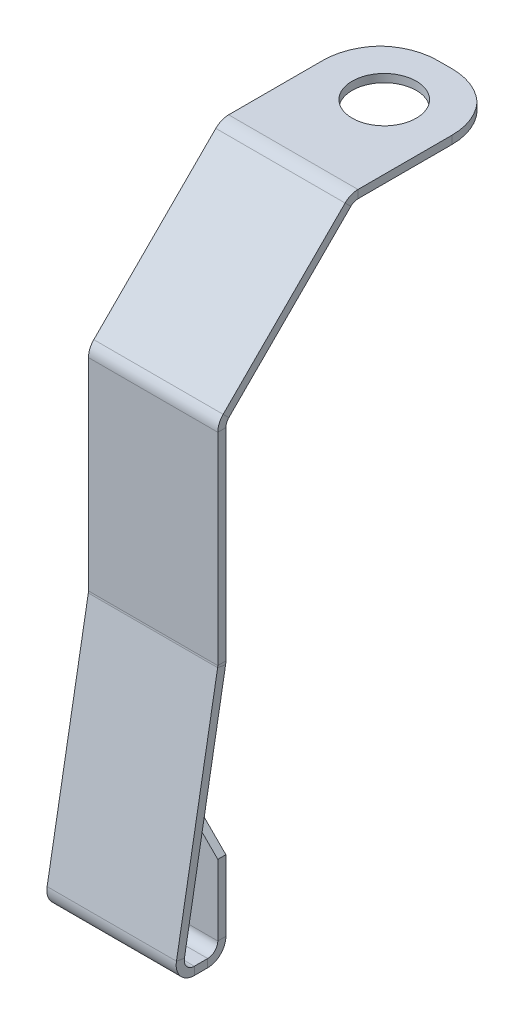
ISO-10303-21;
HEADER;
FILE_DESCRIPTION(('STEP AP214'),'2;1');
FILE_NAME('part.step','',(''),(''),'','','');
FILE_SCHEMA(('AUTOMOTIVE_DESIGN { 1 0 10303 214 1 1 1 1 }'));
ENDSEC;
DATA;
#1=APPLICATION_CONTEXT('core data for automotive mechanical design processes');
#2=APPLICATION_PROTOCOL_DEFINITION('international standard','automotive_design',2000,#1);
#3=PRODUCT_CONTEXT('',#1,'mechanical');
#4=PRODUCT('Part','Part','',(#3));
#5=PRODUCT_RELATED_PRODUCT_CATEGORY('part','',(#4));
#6=PRODUCT_DEFINITION_FORMATION('','',#4);
#7=PRODUCT_DEFINITION_CONTEXT('part definition',#1,'design');
#8=PRODUCT_DEFINITION('design','',#6,#7);
#9=PRODUCT_DEFINITION_SHAPE('','',#8);
#10=(LENGTH_UNIT() NAMED_UNIT(*) SI_UNIT(.MILLI.,.METRE.));
#11=(NAMED_UNIT(*) PLANE_ANGLE_UNIT() SI_UNIT($,.RADIAN.));
#12=(NAMED_UNIT(*) SI_UNIT($,.STERADIAN.) SOLID_ANGLE_UNIT());
#13=UNCERTAINTY_MEASURE_WITH_UNIT(LENGTH_MEASURE(1.E-05),#10,'distance_accuracy_value','');
#14=(GEOMETRIC_REPRESENTATION_CONTEXT(3) GLOBAL_UNCERTAINTY_ASSIGNED_CONTEXT((#13)) GLOBAL_UNIT_ASSIGNED_CONTEXT((#10,
#11,#12)) REPRESENTATION_CONTEXT('',''));
#15=CARTESIAN_POINT('',(0.,0.,0.));
#16=DIRECTION('',(0.,0.,1.));
#17=DIRECTION('',(1.,0.,0.));
#18=AXIS2_PLACEMENT_3D('',#15,#16,#17);
#19=CARTESIAN_POINT('',(-10.16,-94.1087382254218,-12.0896842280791));
#20=DIRECTION('',(-1.,0.,0.));
#21=DIRECTION('',(0.,0.,1.));
#22=AXIS2_PLACEMENT_3D('',#19,#20,#21);
#23=PLANE('',#22);
#24=DIRECTION('',(0.,0.,-1.));
#25=VECTOR('',#24,1.);
#26=CARTESIAN_POINT('',(-10.16,-92.8387382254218,-0.223935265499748));
#27=LINE('',#26,#25);
#28=CARTESIAN_POINT('',(-10.16,-92.8387382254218,-16.0763278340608));
#29=VERTEX_POINT('',#28);
#30=CARTESIAN_POINT('',(-10.16,-92.8387382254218,-13.9815930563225));
#31=VERTEX_POINT('',#30);
#32=EDGE_CURVE('E375',#29,#31,#27,.F.);
#33=ORIENTED_EDGE('',*,*,#32,.F.);
#34=DIRECTION('',(0.,-1.,0.));
#35=VECTOR('',#34,1.);
#36=CARTESIAN_POINT('',(-10.16,-92.8387382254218,-16.0763278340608));
#37=LINE('',#36,#35);
#38=CARTESIAN_POINT('',(-10.16,-94.1087382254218,-16.0763278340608));
#39=VERTEX_POINT('',#38);
#40=EDGE_CURVE('E357',#29,#39,#37,.T.);
#41=ORIENTED_EDGE('',*,*,#40,.T.);
#42=DIRECTION('',(0.,0.,1.));
#43=VECTOR('',#42,1.);
#44=CARTESIAN_POINT('',(-10.16,-94.1087382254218,-12.0896842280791));
#45=LINE('',#44,#43);
#46=CARTESIAN_POINT('',(-10.16,-94.1087382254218,-13.9815930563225));
#47=VERTEX_POINT('',#46);
#48=EDGE_CURVE('E369',#39,#47,#45,.T.);
#49=ORIENTED_EDGE('',*,*,#48,.T.);
#50=DIRECTION('',(0.,-1.,0.));
#51=VECTOR('',#50,1.);
#52=CARTESIAN_POINT('',(-10.16,-92.8387382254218,-13.9815930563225));
#53=LINE('',#52,#51);
#54=EDGE_CURVE('E383',#31,#47,#53,.T.);
#55=ORIENTED_EDGE('',*,*,#54,.F.);
#56=EDGE_LOOP('',(#33,#41,#49,#55));
#57=FACE_BOUND('',#56,.T.);
#58=ADVANCED_FACE('F103',(#57),#23,.T.);
#59=CARTESIAN_POINT('',(0.,-94.1087382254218,-0.223935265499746));
#60=DIRECTION('',(0.,-1.,0.));
#61=DIRECTION('',(0.,0.,-1.));
#62=AXIS2_PLACEMENT_3D('',#59,#60,#61);
#63=PLANE('',#62);
#64=ORIENTED_EDGE('',*,*,#48,.F.);
#65=DIRECTION('',(-1.,0.,0.));
#66=VECTOR('',#65,1.);
#67=CARTESIAN_POINT('',(-10.16,-94.1087382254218,-16.0763278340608));
#68=LINE('',#67,#66);
#69=CARTESIAN_POINT('',(10.1600000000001,-94.1087382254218,-16.0763278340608));
#70=VERTEX_POINT('',#69);
#71=EDGE_CURVE('E309',#39,#70,#68,.F.);
#72=ORIENTED_EDGE('',*,*,#71,.T.);
#73=DIRECTION('',(0.,0.,-1.));
#74=VECTOR('',#73,1.);
#75=CARTESIAN_POINT('',(10.1600000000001,-94.1087382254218,-22.0061571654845));
#76=LINE('',#75,#74);
#77=CARTESIAN_POINT('',(10.1600000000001,-94.1087382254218,-13.9815930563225));
#78=VERTEX_POINT('',#77);
#79=EDGE_CURVE('E372',#78,#70,#76,.T.);
#80=ORIENTED_EDGE('',*,*,#79,.F.);
#81=DIRECTION('',(-1.,0.,0.));
#82=VECTOR('',#81,1.);
#83=CARTESIAN_POINT('',(0.,-94.1087382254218,-13.9815930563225));
#84=LINE('',#83,#82);
#85=EDGE_CURVE('E380',#78,#47,#84,.T.);
#86=ORIENTED_EDGE('',*,*,#85,.T.);
#87=EDGE_LOOP('',(#64,#72,#80,#86));
#88=FACE_BOUND('',#87,.T.);
#89=ADVANCED_FACE('F668',(#88),#63,.T.);
#90=CARTESIAN_POINT('',(0.,-92.8387382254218,-0.223935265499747));
#91=DIRECTION('',(0.,-1.,0.));
#92=DIRECTION('',(0.,0.,-1.));
#93=AXIS2_PLACEMENT_3D('',#90,#91,#92);
#94=PLANE('',#93);
#95=DIRECTION('',(-1.,0.,0.));
#96=VECTOR('',#95,1.);
#97=CARTESIAN_POINT('',(-10.16,-92.8387382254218,-16.0763278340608));
#98=LINE('',#97,#96);
#99=CARTESIAN_POINT('',(10.1600000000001,-92.8387382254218,-16.0763278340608));
#100=VERTEX_POINT('',#99);
#101=EDGE_CURVE('E361',#29,#100,#98,.F.);
#102=ORIENTED_EDGE('',*,*,#101,.F.);
#103=ORIENTED_EDGE('',*,*,#32,.T.);
#104=DIRECTION('',(1.,0.,0.));
#105=VECTOR('',#104,1.);
#106=CARTESIAN_POINT('',(10.1600000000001,-92.8387382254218,-13.9815930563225));
#107=LINE('',#106,#105);
#108=CARTESIAN_POINT('',(10.1600000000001,-92.8387382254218,-13.9815930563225));
#109=VERTEX_POINT('',#108);
#110=EDGE_CURVE('E386',#109,#31,#107,.F.);
#111=ORIENTED_EDGE('',*,*,#110,.F.);
#112=DIRECTION('',(0.,0.,1.));
#113=VECTOR('',#112,1.);
#114=CARTESIAN_POINT('',(10.16,-92.8387382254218,-0.223935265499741));
#115=LINE('',#114,#113);
#116=EDGE_CURVE('E377',#109,#100,#115,.F.);
#117=ORIENTED_EDGE('',*,*,#116,.T.);
#118=EDGE_LOOP('',(#102,#103,#111,#117));
#119=FACE_BOUND('',#118,.T.);
#120=ADVANCED_FACE('F674',(#119),#94,.F.);
#121=CARTESIAN_POINT('',(0.,-31.5734459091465,-22.8924082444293));
#122=DIRECTION('',(0.,-0.173648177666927,-0.984807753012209));
#123=DIRECTION('',(0.,0.984807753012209,-0.173648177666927));
#124=AXIS2_PLACEMENT_3D('',#121,#122,#123);
#125=PLANE('',#124);
#126=DIRECTION('',(0.,0.984807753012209,-0.173648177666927));
#127=VECTOR('',#126,1.);
#128=CARTESIAN_POINT('',(10.1600000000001,-94.1087382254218,-11.8657489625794));
#129=LINE('',#128,#127);
#130=CARTESIAN_POINT('',(10.1600000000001,-90.9755717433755,-12.4182107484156));
#131=VERTEX_POINT('',#130);
#132=CARTESIAN_POINT('',(10.16,-54.2698718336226,-18.8904159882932));
#133=VERTEX_POINT('',#132);
#134=EDGE_CURVE('E427',#131,#133,#129,.T.);
#135=ORIENTED_EDGE('',*,*,#134,.F.);
#136=DIRECTION('',(-1.,0.,0.));
#137=VECTOR('',#136,1.);
#138=CARTESIAN_POINT('',(-10.16,-90.9755717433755,-12.4182107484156));
#139=LINE('',#138,#137);
#140=CARTESIAN_POINT('',(-10.16,-90.9755717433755,-12.4182107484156));
#141=VERTEX_POINT('',#140);
#142=EDGE_CURVE('E403',#141,#131,#139,.F.);
#143=ORIENTED_EDGE('',*,*,#142,.F.);
#144=DIRECTION('',(0.,-0.984807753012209,0.173648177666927));
#145=VECTOR('',#144,1.);
#146=CARTESIAN_POINT('',(-10.16,-94.1087382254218,-11.8657489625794));
#147=LINE('',#146,#145);
#148=CARTESIAN_POINT('',(-10.16,-54.2698718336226,-18.8904159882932));
#149=VERTEX_POINT('',#148);
#150=EDGE_CURVE('E414',#149,#141,#147,.T.);
#151=ORIENTED_EDGE('',*,*,#150,.F.);
#152=DIRECTION('',(1.,0.,0.));
#153=VECTOR('',#152,1.);
#154=CARTESIAN_POINT('',(0.,-54.2698718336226,-18.8904159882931));
#155=LINE('',#154,#153);
#156=EDGE_CURVE('E429',#149,#133,#155,.T.);
#157=ORIENTED_EDGE('',*,*,#156,.T.);
#158=EDGE_LOOP('',(#135,#143,#151,#157));
#159=FACE_BOUND('',#158,.T.);
#160=ADVANCED_FACE('F702',(#159),#125,.T.);
#161=CARTESIAN_POINT('',(0.,-31.3529127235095,-21.6417023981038));
#162=DIRECTION('',(0.,-0.173648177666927,-0.984807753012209));
#163=DIRECTION('',(0.,0.984807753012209,-0.173648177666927));
#164=AXIS2_PLACEMENT_3D('',#161,#162,#163);
#165=PLANE('',#164);
#166=DIRECTION('',(-1.,0.,0.));
#167=VECTOR('',#166,1.);
#168=CARTESIAN_POINT('',(-10.16,-90.7550385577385,-11.1675049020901));
#169=LINE('',#168,#167);
#170=CARTESIAN_POINT('',(-10.16,-90.7550385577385,-11.1675049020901));
#171=VERTEX_POINT('',#170);
#172=CARTESIAN_POINT('',(10.1600000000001,-90.7550385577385,-11.1675049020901));
#173=VERTEX_POINT('',#172);
#174=EDGE_CURVE('E391',#171,#173,#169,.F.);
#175=ORIENTED_EDGE('',*,*,#174,.T.);
#176=DIRECTION('',(0.,0.984807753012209,-0.173648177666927));
#177=VECTOR('',#176,1.);
#178=CARTESIAN_POINT('',(10.1600000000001,-93.8882050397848,-10.6150431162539));
#179=LINE('',#178,#177);
#180=CARTESIAN_POINT('',(10.16,-54.0493386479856,-17.6397101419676));
#181=VERTEX_POINT('',#180);
#182=EDGE_CURVE('E420',#173,#181,#179,.T.);
#183=ORIENTED_EDGE('',*,*,#182,.T.);
#184=DIRECTION('',(1.,0.,0.));
#185=VECTOR('',#184,1.);
#186=CARTESIAN_POINT('',(0.,-54.0493386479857,-17.6397101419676));
#187=LINE('',#186,#185);
#188=CARTESIAN_POINT('',(-10.16,-54.0493386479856,-17.6397101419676));
#189=VERTEX_POINT('',#188);
#190=EDGE_CURVE('E411',#189,#181,#187,.T.);
#191=ORIENTED_EDGE('',*,*,#190,.F.);
#192=DIRECTION('',(0.,-0.984807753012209,0.173648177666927));
#193=VECTOR('',#192,1.);
#194=CARTESIAN_POINT('',(-10.16,-93.8882050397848,-10.6150431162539));
#195=LINE('',#194,#193);
#196=EDGE_CURVE('E422',#189,#171,#195,.T.);
#197=ORIENTED_EDGE('',*,*,#196,.T.);
#198=EDGE_LOOP('',(#175,#183,#191,#197));
#199=FACE_BOUND('',#198,.T.);
#200=ADVANCED_FACE('F705',(#199),#165,.F.);
#201=CARTESIAN_POINT('',(-10.16,-94.1087382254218,-11.8657489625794));
#202=DIRECTION('',(-1.,0.,0.));
#203=DIRECTION('',(0.,-0.984807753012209,0.173648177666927));
#204=AXIS2_PLACEMENT_3D('',#201,#202,#203);
#205=PLANE('',#204);
#206=ORIENTED_EDGE('',*,*,#150,.T.);
#207=DIRECTION('',(0.,0.173648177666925,0.984807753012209));
#208=VECTOR('',#207,1.);
#209=CARTESIAN_POINT('',(-10.16,-90.9755717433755,-12.4182107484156));
#210=LINE('',#209,#208);
#211=EDGE_CURVE('E397',#141,#171,#210,.T.);
#212=ORIENTED_EDGE('',*,*,#211,.T.);
#213=ORIENTED_EDGE('',*,*,#196,.F.);
#214=DIRECTION('',(0.,-0.173648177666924,-0.984807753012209));
#215=VECTOR('',#214,1.);
#216=CARTESIAN_POINT('',(-10.16,-54.2698718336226,-18.890415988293));
#217=LINE('',#216,#215);
#218=EDGE_CURVE('E418',#189,#149,#217,.T.);
#219=ORIENTED_EDGE('',*,*,#218,.T.);
#220=EDGE_LOOP('',(#206,#212,#213,#219));
#221=FACE_BOUND('',#220,.T.);
#222=ADVANCED_FACE('F713',(#221),#205,.T.);
#223=CARTESIAN_POINT('',(0.,-31.1150167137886,-17.6638278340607));
#224=DIRECTION('',(0.,0.,-1.));
#225=DIRECTION('',(0.,1.,0.));
#226=AXIS2_PLACEMENT_3D('',#223,#224,#225);
#227=PLANE('',#226);
#228=DIRECTION('',(0.,-1.,0.));
#229=VECTOR('',#228,1.);
#230=CARTESIAN_POINT('',(-10.16,-94.6150167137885,-17.6638278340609));
#231=LINE('',#230,#229);
#232=CARTESIAN_POINT('',(-10.16,-22.0236721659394,-17.6638278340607));
#233=VERTEX_POINT('',#232);
#234=CARTESIAN_POINT('',(-10.16,-53.7736721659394,-17.6638278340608));
#235=VERTEX_POINT('',#234);
#236=EDGE_CURVE('E453',#233,#235,#231,.T.);
#237=ORIENTED_EDGE('',*,*,#236,.T.);
#238=DIRECTION('',(1.,0.,0.));
#239=VECTOR('',#238,1.);
#240=CARTESIAN_POINT('',(0.,-53.7736721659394,-17.6638278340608));
#241=LINE('',#240,#239);
#242=CARTESIAN_POINT('',(10.16,-53.7736721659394,-17.6638278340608));
#243=VERTEX_POINT('',#242);
#244=EDGE_CURVE('E554',#235,#243,#241,.T.);
#245=ORIENTED_EDGE('',*,*,#244,.T.);
#246=DIRECTION('',(0.,1.,0.));
#247=VECTOR('',#246,1.);
#248=CARTESIAN_POINT('',(10.1600000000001,-94.6150167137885,-17.6638278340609));
#249=LINE('',#248,#247);
#250=CARTESIAN_POINT('',(10.16,-22.0236721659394,-17.6638278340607));
#251=VERTEX_POINT('',#250);
#252=EDGE_CURVE('E449',#243,#251,#249,.T.);
#253=ORIENTED_EDGE('',*,*,#252,.T.);
#254=DIRECTION('',(1.,0.,0.));
#255=VECTOR('',#254,1.);
#256=CARTESIAN_POINT('',(0.,-22.0236721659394,-17.6638278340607));
#257=LINE('',#256,#255);
#258=EDGE_CURVE('E441',#233,#251,#257,.T.);
#259=ORIENTED_EDGE('',*,*,#258,.F.);
#260=EDGE_LOOP('',(#237,#245,#253,#259));
#261=FACE_BOUND('',#260,.T.);
#262=ADVANCED_FACE('F717',(#261),#227,.F.);
#263=CARTESIAN_POINT('',(0.,-27.6659543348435,-10.8379304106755));
#264=DIRECTION('',(0.,-0.707106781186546,-0.707106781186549));
#265=DIRECTION('',(0.,0.707106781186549,-0.707106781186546));
#266=AXIS2_PLACEMENT_3D('',#263,#264,#265);
#267=PLANE('',#266);
#268=DIRECTION('',(0.,-0.707106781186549,0.707106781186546));
#269=VECTOR('',#268,1.);
#270=CARTESIAN_POINT('',(-10.16,-72.5672349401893,34.0633501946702));
#271=LINE('',#270,#269);
#272=CARTESIAN_POINT('',(-10.16,-0.836942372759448,-37.6669423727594));
#273=VERTEX_POINT('',#272);
#274=CARTESIAN_POINT('',(-10.16,-20.0031145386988,-18.5007702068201));
#275=VERTEX_POINT('',#274);
#276=EDGE_CURVE('E545',#273,#275,#271,.T.);
#277=ORIENTED_EDGE('',*,*,#276,.T.);
#278=DIRECTION('',(1.,0.,0.));
#279=VECTOR('',#278,1.);
#280=CARTESIAN_POINT('',(0.,-20.0031145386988,-18.5007702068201));
#281=LINE('',#280,#279);
#282=CARTESIAN_POINT('',(10.16,-20.0031145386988,-18.5007702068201));
#283=VERTEX_POINT('',#282);
#284=EDGE_CURVE('E534',#275,#283,#281,.T.);
#285=ORIENTED_EDGE('',*,*,#284,.T.);
#286=DIRECTION('',(0.,0.707106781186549,-0.707106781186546));
#287=VECTOR('',#286,1.);
#288=CARTESIAN_POINT('',(10.16,-72.5672349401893,34.0633501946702));
#289=LINE('',#288,#287);
#290=CARTESIAN_POINT('',(10.16,-0.836942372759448,-37.6669423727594));
#291=VERTEX_POINT('',#290);
#292=EDGE_CURVE('E487',#283,#291,#289,.T.);
#293=ORIENTED_EDGE('',*,*,#292,.T.);
#294=DIRECTION('',(1.,0.,0.));
#295=VECTOR('',#294,1.);
#296=CARTESIAN_POINT('',(0.,-0.836942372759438,-37.6669423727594));
#297=LINE('',#296,#295);
#298=EDGE_CURVE('E523',#273,#291,#297,.T.);
#299=ORIENTED_EDGE('',*,*,#298,.F.);
#300=EDGE_LOOP('',(#277,#285,#293,#299));
#301=FACE_BOUND('',#300,.T.);
#302=ADVANCED_FACE('F1085',(#301),#267,.F.);
#303=CARTESIAN_POINT('',(10.16,-73.4652605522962,33.1653245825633));
#304=DIRECTION('',(1.,0.,0.));
#305=DIRECTION('',(0.,0.707106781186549,-0.707106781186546));
#306=AXIS2_PLACEMENT_3D('',#303,#304,#305);
#307=PLANE('',#306);
#308=DIRECTION('',(0.,0.707106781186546,0.707106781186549));
#309=VECTOR('',#308,1.);
#310=CARTESIAN_POINT('',(10.16,-20.9011401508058,-19.398795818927));
#311=LINE('',#310,#309);
#312=CARTESIAN_POINT('',(10.16,-20.9011401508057,-19.398795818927));
#313=VERTEX_POINT('',#312);
#314=EDGE_CURVE('E531',#313,#283,#311,.T.);
#315=ORIENTED_EDGE('',*,*,#314,.F.);
#316=DIRECTION('',(0.,0.707106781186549,-0.707106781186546));
#317=VECTOR('',#316,1.);
#318=CARTESIAN_POINT('',(10.16,-73.4652605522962,33.1653245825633));
#319=LINE('',#318,#317);
#320=CARTESIAN_POINT('',(10.16,-1.73496798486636,-38.5649679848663));
#321=VERTEX_POINT('',#320);
#322=EDGE_CURVE('E542',#313,#321,#319,.T.);
#323=ORIENTED_EDGE('',*,*,#322,.T.);
#324=DIRECTION('',(0.,0.707106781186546,0.707106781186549));
#325=VECTOR('',#324,1.);
#326=CARTESIAN_POINT('',(10.16,-1.73496798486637,-38.5649679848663));
#327=LINE('',#326,#325);
#328=EDGE_CURVE('E525',#321,#291,#327,.T.);
#329=ORIENTED_EDGE('',*,*,#328,.T.);
#330=ORIENTED_EDGE('',*,*,#292,.F.);
#331=EDGE_LOOP('',(#315,#323,#329,#330));
#332=FACE_BOUND('',#331,.T.);
#333=ADVANCED_FACE('F631',(#332),#307,.T.);
#334=CARTESIAN_POINT('',(-10.16,-73.4652605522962,33.1653245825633));
#335=DIRECTION('',(-1.,0.,0.));
#336=DIRECTION('',(0.,-0.707106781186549,0.707106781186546));
#337=AXIS2_PLACEMENT_3D('',#334,#335,#336);
#338=PLANE('',#337);
#339=DIRECTION('',(0.,-0.707106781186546,-0.707106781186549));
#340=VECTOR('',#339,1.);
#341=CARTESIAN_POINT('',(-10.16,-20.9011401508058,-19.398795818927));
#342=LINE('',#341,#340);
#343=CARTESIAN_POINT('',(-10.16,-20.9011401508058,-19.398795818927));
#344=VERTEX_POINT('',#343);
#345=EDGE_CURVE('E537',#275,#344,#342,.T.);
#346=ORIENTED_EDGE('',*,*,#345,.F.);
#347=ORIENTED_EDGE('',*,*,#276,.F.);
#348=DIRECTION('',(0.,-0.707106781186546,-0.707106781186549));
#349=VECTOR('',#348,1.);
#350=CARTESIAN_POINT('',(-10.16,-1.73496798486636,-38.5649679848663));
#351=LINE('',#350,#349);
#352=CARTESIAN_POINT('',(-10.16,-1.73496798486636,-38.5649679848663));
#353=VERTEX_POINT('',#352);
#354=EDGE_CURVE('E519',#273,#353,#351,.T.);
#355=ORIENTED_EDGE('',*,*,#354,.T.);
#356=DIRECTION('',(0.,-0.707106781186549,0.707106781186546));
#357=VECTOR('',#356,1.);
#358=CARTESIAN_POINT('',(-10.16,-73.4652605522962,33.1653245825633));
#359=LINE('',#358,#357);
#360=EDGE_CURVE('E520',#353,#344,#359,.T.);
#361=ORIENTED_EDGE('',*,*,#360,.T.);
#362=EDGE_LOOP('',(#346,#347,#355,#361));
#363=FACE_BOUND('',#362,.T.);
#364=ADVANCED_FACE('F1138',(#363),#338,.T.);
#365=CARTESIAN_POINT('',(0.,-28.5639799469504,-11.7359560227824));
#366=DIRECTION('',(0.,-0.707106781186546,-0.707106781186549));
#367=DIRECTION('',(0.,0.707106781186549,-0.707106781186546));
#368=AXIS2_PLACEMENT_3D('',#365,#366,#367);
#369=PLANE('',#368);
#370=DIRECTION('',(1.,0.,0.));
#371=VECTOR('',#370,1.);
#372=CARTESIAN_POINT('',(0.,-20.9011401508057,-19.398795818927));
#373=LINE('',#372,#371);
#374=EDGE_CURVE('E528',#344,#313,#373,.T.);
#375=ORIENTED_EDGE('',*,*,#374,.F.);
#376=ORIENTED_EDGE('',*,*,#360,.F.);
#377=DIRECTION('',(1.,0.,0.));
#378=VECTOR('',#377,1.);
#379=CARTESIAN_POINT('',(0.,-1.73496798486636,-38.5649679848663));
#380=LINE('',#379,#378);
#381=EDGE_CURVE('E516',#353,#321,#380,.T.);
#382=ORIENTED_EDGE('',*,*,#381,.T.);
#383=ORIENTED_EDGE('',*,*,#322,.F.);
#384=EDGE_LOOP('',(#375,#376,#382,#383));
#385=FACE_BOUND('',#384,.T.);
#386=ADVANCED_FACE('F635',(#385),#369,.T.);
#387=CARTESIAN_POINT('',(0.,0.,-53.975));
#388=DIRECTION('',(0.,1.,0.));
#389=DIRECTION('',(0.,0.,1.));
#390=AXIS2_PLACEMENT_3D('',#387,#388,#389);
#391=CYLINDRICAL_SURFACE('',#390,5.04189999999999);
#392=CARTESIAN_POINT('',(0.,0.,-53.975));
#393=DIRECTION('',(0.,1.,0.));
#394=DIRECTION('',(0.,0.,1.));
#395=AXIS2_PLACEMENT_3D('',#392,#393,#394);
#396=CIRCLE('',#395,5.04189999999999);
#397=CARTESIAN_POINT('',(0.,0.,-48.9331));
#398=VERTEX_POINT('',#397);
#399=EDGE_CURVE('E505',#398,#398,#396,.T.);
#400=ORIENTED_EDGE('',*,*,#399,.T.);
#401=EDGE_LOOP('',(#400));
#402=FACE_BOUND('',#401,.T.);
#403=CARTESIAN_POINT('',(0.,-1.27,-53.975));
#404=DIRECTION('',(0.,-1.,0.));
#405=DIRECTION('',(0.,0.,-1.));
#406=AXIS2_PLACEMENT_3D('',#403,#404,#405);
#407=CIRCLE('',#406,5.04189999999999);
#408=CARTESIAN_POINT('',(0.,-1.27,-59.0169));
#409=VERTEX_POINT('',#408);
#410=EDGE_CURVE('E502',#409,#409,#407,.T.);
#411=ORIENTED_EDGE('',*,*,#410,.T.);
#412=EDGE_LOOP('',(#411));
#413=FACE_BOUND('',#412,.T.);
#414=ADVANCED_FACE('F658',(#402,#413),#391,.F.);
#415=CARTESIAN_POINT('',(-10.16,-1.27,-63.5));
#416=DIRECTION('',(0.,0.,-1.));
#417=DIRECTION('',(-1.,0.,0.));
#418=AXIS2_PLACEMENT_3D('',#415,#416,#417);
#419=PLANE('',#418);
#420=DIRECTION('',(-1.,0.,0.));
#421=VECTOR('',#420,1.);
#422=CARTESIAN_POINT('',(-10.16,-1.27,-63.5));
#423=LINE('',#422,#421);
#424=CARTESIAN_POINT('',(1.13461581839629,-1.27,-63.5));
#425=VERTEX_POINT('',#424);
#426=CARTESIAN_POINT('',(-1.13461581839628,-1.27,-63.5));
#427=VERTEX_POINT('',#426);
#428=EDGE_CURVE('E499',#425,#427,#423,.T.);
#429=ORIENTED_EDGE('',*,*,#428,.T.);
#430=DIRECTION('',(0.,-1.,0.));
#431=VECTOR('',#430,1.);
#432=CARTESIAN_POINT('',(-1.13461581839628,-1.27,-63.5));
#433=LINE('',#432,#431);
#434=CARTESIAN_POINT('',(-1.13461581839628,0.,-63.5));
#435=VERTEX_POINT('',#434);
#436=EDGE_CURVE('E112',#427,#435,#433,.F.);
#437=ORIENTED_EDGE('',*,*,#436,.T.);
#438=DIRECTION('',(-1.,0.,0.));
#439=VECTOR('',#438,1.);
#440=CARTESIAN_POINT('',(-10.16,0.,-63.5));
#441=LINE('',#440,#439);
#442=CARTESIAN_POINT('',(1.13461581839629,0.,-63.5));
#443=VERTEX_POINT('',#442);
#444=EDGE_CURVE('E488',#443,#435,#441,.T.);
#445=ORIENTED_EDGE('',*,*,#444,.F.);
#446=DIRECTION('',(0.,1.,0.));
#447=VECTOR('',#446,1.);
#448=CARTESIAN_POINT('',(1.13461581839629,-1.27,-63.5));
#449=LINE('',#448,#447);
#450=EDGE_CURVE('E598',#443,#425,#449,.F.);
#451=ORIENTED_EDGE('',*,*,#450,.T.);
#452=EDGE_LOOP('',(#429,#437,#445,#451));
#453=FACE_BOUND('',#452,.T.);
#454=ADVANCED_FACE('F656',(#453),#419,.T.);
#455=CARTESIAN_POINT('',(0.,-1.27,0.));
#456=DIRECTION('',(0.,-1.,0.));
#457=DIRECTION('',(0.,0.,-1.));
#458=AXIS2_PLACEMENT_3D('',#455,#456,#457);
#459=PLANE('',#458);
#460=DIRECTION('',(0.,0.,1.));
#461=VECTOR('',#460,1.);
#462=CARTESIAN_POINT('',(-10.16,-1.27,63.5));
#463=LINE('',#462,#461);
#464=CARTESIAN_POINT('',(-10.16,-1.27,-54.4746158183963));
#465=VERTEX_POINT('',#464);
#466=CARTESIAN_POINT('',(-10.16,-1.27,-39.6875));
#467=VERTEX_POINT('',#466);
#468=EDGE_CURVE('E497',#465,#467,#463,.T.);
#469=ORIENTED_EDGE('',*,*,#468,.F.);
#470=CARTESIAN_POINT('',(-0.635000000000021,-1.27,-54.4746158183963));
#471=DIRECTION('',(0.,-1.,0.));
#472=DIRECTION('',(0.,0.,-1.));
#473=AXIS2_PLACEMENT_3D('',#470,#471,#472);
#474=CIRCLE('',#473,9.525);
#475=CARTESIAN_POINT('',(-7.61536572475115,-1.27,-60.9553657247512));
#476=VERTEX_POINT('',#475);
#477=EDGE_CURVE('E590',#465,#476,#474,.T.);
#478=ORIENTED_EDGE('',*,*,#477,.T.);
#479=CARTESIAN_POINT('',(-1.13461581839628,-1.27,-53.975));
#480=DIRECTION('',(0.,-1.,0.));
#481=DIRECTION('',(0.,0.,-1.));
#482=AXIS2_PLACEMENT_3D('',#479,#480,#481);
#483=CIRCLE('',#482,9.525);
#484=EDGE_CURVE('E588',#476,#427,#483,.T.);
#485=ORIENTED_EDGE('',*,*,#484,.T.);
#486=ORIENTED_EDGE('',*,*,#428,.F.);
#487=CARTESIAN_POINT('',(1.13461581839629,-1.27,-53.975));
#488=DIRECTION('',(0.,-1.,0.));
#489=DIRECTION('',(0.,0.,-1.));
#490=AXIS2_PLACEMENT_3D('',#487,#488,#489);
#491=CIRCLE('',#490,9.525);
#492=CARTESIAN_POINT('',(7.61536572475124,-1.27,-60.9553657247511));
#493=VERTEX_POINT('',#492);
#494=EDGE_CURVE('E586',#425,#493,#491,.T.);
#495=ORIENTED_EDGE('',*,*,#494,.T.);
#496=CARTESIAN_POINT('',(0.635000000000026,-1.27,-54.4746158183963));
#497=DIRECTION('',(0.,-1.,0.));
#498=DIRECTION('',(0.,0.,-1.));
#499=AXIS2_PLACEMENT_3D('',#496,#497,#498);
#500=CIRCLE('',#499,9.525);
#501=CARTESIAN_POINT('',(10.16,-1.27,-54.4746158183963));
#502=VERTEX_POINT('',#501);
#503=EDGE_CURVE('E584',#493,#502,#500,.T.);
#504=ORIENTED_EDGE('',*,*,#503,.T.);
#505=DIRECTION('',(0.,0.,-1.));
#506=VECTOR('',#505,1.);
#507=CARTESIAN_POINT('',(10.16,-1.27,63.5));
#508=LINE('',#507,#506);
#509=CARTESIAN_POINT('',(10.16,-1.27,-39.6875));
#510=VERTEX_POINT('',#509);
#511=EDGE_CURVE('E484',#510,#502,#508,.T.);
#512=ORIENTED_EDGE('',*,*,#511,.F.);
#513=DIRECTION('',(1.,0.,0.));
#514=VECTOR('',#513,1.);
#515=CARTESIAN_POINT('',(0.,-1.27,-39.6875));
#516=LINE('',#515,#514);
#517=EDGE_CURVE('E479',#467,#510,#516,.T.);
#518=ORIENTED_EDGE('',*,*,#517,.F.);
#519=EDGE_LOOP('',(#469,#478,#485,#486,#495,#504,#512,#518));
#520=FACE_BOUND('',#519,.T.);
#521=ORIENTED_EDGE('',*,*,#410,.F.);
#522=EDGE_LOOP('',(#521));
#523=FACE_BOUND('',#522,.T.);
#524=ADVANCED_FACE('F614',(#520,#523),#459,.T.);
#525=CARTESIAN_POINT('',(-10.16,-1.27,63.5));
#526=DIRECTION('',(-1.,0.,0.));
#527=DIRECTION('',(0.,0.,1.));
#528=AXIS2_PLACEMENT_3D('',#525,#526,#527);
#529=PLANE('',#528);
#530=DIRECTION('',(0.,0.,1.));
#531=VECTOR('',#530,1.);
#532=CARTESIAN_POINT('',(-10.16,0.,63.5));
#533=LINE('',#532,#531);
#534=CARTESIAN_POINT('',(-10.16,0.,-54.4746158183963));
#535=VERTEX_POINT('',#534);
#536=CARTESIAN_POINT('',(-10.16,0.,-39.6875));
#537=VERTEX_POINT('',#536);
#538=EDGE_CURVE('E495',#535,#537,#533,.T.);
#539=ORIENTED_EDGE('',*,*,#538,.F.);
#540=DIRECTION('',(0.,1.,0.));
#541=VECTOR('',#540,1.);
#542=CARTESIAN_POINT('',(-10.16,-1.27,-54.4746158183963));
#543=LINE('',#542,#541);
#544=EDGE_CURVE('E581',#535,#465,#543,.F.);
#545=ORIENTED_EDGE('',*,*,#544,.T.);
#546=ORIENTED_EDGE('',*,*,#468,.T.);
#547=DIRECTION('',(0.,-1.,0.));
#548=VECTOR('',#547,1.);
#549=CARTESIAN_POINT('',(-10.16,-1.27000000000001,-39.6875));
#550=LINE('',#549,#548);
#551=EDGE_CURVE('E508',#537,#467,#550,.T.);
#552=ORIENTED_EDGE('',*,*,#551,.F.);
#553=EDGE_LOOP('',(#539,#545,#546,#552));
#554=FACE_BOUND('',#553,.T.);
#555=ADVANCED_FACE('F643',(#554),#529,.T.);
#556=CARTESIAN_POINT('',(0.,0.,0.));
#557=DIRECTION('',(0.,-1.,0.));
#558=DIRECTION('',(0.,0.,-1.));
#559=AXIS2_PLACEMENT_3D('',#556,#557,#558);
#560=PLANE('',#559);
#561=ORIENTED_EDGE('',*,*,#399,.F.);
#562=EDGE_LOOP('',(#561));
#563=FACE_BOUND('',#562,.T.);
#564=CARTESIAN_POINT('',(-1.13461581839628,0.,-53.975));
#565=DIRECTION('',(0.,-1.,0.));
#566=DIRECTION('',(0.,0.,-1.));
#567=AXIS2_PLACEMENT_3D('',#564,#565,#566);
#568=CIRCLE('',#567,9.525);
#569=CARTESIAN_POINT('',(-7.61536572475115,0.,-60.9553657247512));
#570=VERTEX_POINT('',#569);
#571=EDGE_CURVE('E120',#435,#570,#568,.F.);
#572=ORIENTED_EDGE('',*,*,#571,.T.);
#573=CARTESIAN_POINT('',(-0.635000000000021,0.,-54.4746158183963));
#574=DIRECTION('',(0.,-1.,0.));
#575=DIRECTION('',(0.,0.,-1.));
#576=AXIS2_PLACEMENT_3D('',#573,#574,#575);
#577=CIRCLE('',#576,9.525);
#578=EDGE_CURVE('E596',#570,#535,#577,.F.);
#579=ORIENTED_EDGE('',*,*,#578,.T.);
#580=ORIENTED_EDGE('',*,*,#538,.T.);
#581=DIRECTION('',(1.,0.,0.));
#582=VECTOR('',#581,1.);
#583=CARTESIAN_POINT('',(0.,0.,-39.6875));
#584=LINE('',#583,#582);
#585=CARTESIAN_POINT('',(10.16,0.,-39.6875));
#586=VERTEX_POINT('',#585);
#587=EDGE_CURVE('E492',#537,#586,#584,.T.);
#588=ORIENTED_EDGE('',*,*,#587,.T.);
#589=DIRECTION('',(0.,0.,-1.));
#590=VECTOR('',#589,1.);
#591=CARTESIAN_POINT('',(10.16,0.,63.5));
#592=LINE('',#591,#590);
#593=CARTESIAN_POINT('',(10.16,0.,-54.4746158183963));
#594=VERTEX_POINT('',#593);
#595=EDGE_CURVE('E490',#586,#594,#592,.T.);
#596=ORIENTED_EDGE('',*,*,#595,.T.);
#597=CARTESIAN_POINT('',(0.635000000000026,0.,-54.4746158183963));
#598=DIRECTION('',(0.,-1.,0.));
#599=DIRECTION('',(0.,0.,-1.));
#600=AXIS2_PLACEMENT_3D('',#597,#598,#599);
#601=CIRCLE('',#600,9.525);
#602=CARTESIAN_POINT('',(7.61536572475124,0.,-60.9553657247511));
#603=VERTEX_POINT('',#602);
#604=EDGE_CURVE('E127',#594,#603,#601,.F.);
#605=ORIENTED_EDGE('',*,*,#604,.T.);
#606=CARTESIAN_POINT('',(1.13461581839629,0.,-53.975));
#607=DIRECTION('',(0.,-1.,0.));
#608=DIRECTION('',(0.,0.,-1.));
#609=AXIS2_PLACEMENT_3D('',#606,#607,#608);
#610=CIRCLE('',#609,9.525);
#611=EDGE_CURVE('E593',#603,#443,#610,.F.);
#612=ORIENTED_EDGE('',*,*,#611,.T.);
#613=ORIENTED_EDGE('',*,*,#444,.T.);
#614=EDGE_LOOP('',(#572,#579,#580,#588,#596,#605,#612,#613));
#615=FACE_BOUND('',#614,.T.);
#616=ADVANCED_FACE('F648',(#563,#615),#560,.F.);
#617=CARTESIAN_POINT('',(10.16,-1.27,63.5));
#618=DIRECTION('',(1.,0.,0.));
#619=DIRECTION('',(0.,0.,-1.));
#620=AXIS2_PLACEMENT_3D('',#617,#618,#619);
#621=PLANE('',#620);
#622=ORIENTED_EDGE('',*,*,#511,.T.);
#623=DIRECTION('',(0.,-1.,0.));
#624=VECTOR('',#623,1.);
#625=CARTESIAN_POINT('',(10.16,-1.27,-54.4746158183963));
#626=LINE('',#625,#624);
#627=EDGE_CURVE('E15',#502,#594,#626,.F.);
#628=ORIENTED_EDGE('',*,*,#627,.T.);
#629=ORIENTED_EDGE('',*,*,#595,.F.);
#630=DIRECTION('',(0.,1.,0.));
#631=VECTOR('',#630,1.);
#632=CARTESIAN_POINT('',(10.16,-1.27000000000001,-39.6875));
#633=LINE('',#632,#631);
#634=EDGE_CURVE('E511',#510,#586,#633,.T.);
#635=ORIENTED_EDGE('',*,*,#634,.F.);
#636=EDGE_LOOP('',(#622,#628,#629,#635));
#637=FACE_BOUND('',#636,.T.);
#638=ADVANCED_FACE('F620',(#637),#621,.T.);
#639=CARTESIAN_POINT('',(-10.16,-2.8575,-39.6875));
#640=DIRECTION('',(1.,0.,0.));
#641=DIRECTION('',(0.,0.,-1.));
#642=AXIS2_PLACEMENT_3D('',#639,#640,#641);
#643=PLANE('',#642);
#644=ORIENTED_EDGE('',*,*,#354,.F.);
#645=CARTESIAN_POINT('',(-10.16,-2.8575,-39.6875));
#646=DIRECTION('',(-1.,0.,0.));
#647=DIRECTION('',(0.,0.,1.));
#648=AXIS2_PLACEMENT_3D('',#645,#646,#647);
#649=CIRCLE('',#648,2.8575);
#650=EDGE_CURVE('E467',#273,#537,#649,.T.);
#651=ORIENTED_EDGE('',*,*,#650,.T.);
#652=ORIENTED_EDGE('',*,*,#551,.T.);
#653=CARTESIAN_POINT('',(-10.16,-2.8575,-39.6875));
#654=DIRECTION('',(-1.,0.,0.));
#655=DIRECTION('',(0.,0.,-1.));
#656=AXIS2_PLACEMENT_3D('',#653,#654,#655);
#657=CIRCLE('',#656,1.5875);
#658=EDGE_CURVE('E473',#353,#467,#657,.T.);
#659=ORIENTED_EDGE('',*,*,#658,.F.);
#660=EDGE_LOOP('',(#644,#651,#652,#659));
#661=FACE_BOUND('',#660,.T.);
#662=ADVANCED_FACE('F637',(#661),#643,.F.);
#663=CARTESIAN_POINT('',(10.16,-2.8575,-39.6875));
#664=DIRECTION('',(-1.,0.,0.));
#665=DIRECTION('',(0.,0.,1.));
#666=AXIS2_PLACEMENT_3D('',#663,#664,#665);
#667=PLANE('',#666);
#668=CARTESIAN_POINT('',(10.16,-2.8575,-39.6875));
#669=DIRECTION('',(-1.,0.,0.));
#670=DIRECTION('',(0.,0.,1.));
#671=AXIS2_PLACEMENT_3D('',#668,#669,#670);
#672=CIRCLE('',#671,2.8575);
#673=EDGE_CURVE('E477',#586,#291,#672,.F.);
#674=ORIENTED_EDGE('',*,*,#673,.T.);
#675=ORIENTED_EDGE('',*,*,#328,.F.);
#676=CARTESIAN_POINT('',(10.16,-2.8575,-39.6875));
#677=DIRECTION('',(1.,0.,0.));
#678=DIRECTION('',(0.,0.,1.));
#679=AXIS2_PLACEMENT_3D('',#676,#677,#678);
#680=CIRCLE('',#679,1.5875);
#681=EDGE_CURVE('E476',#510,#321,#680,.T.);
#682=ORIENTED_EDGE('',*,*,#681,.F.);
#683=ORIENTED_EDGE('',*,*,#634,.T.);
#684=EDGE_LOOP('',(#674,#675,#682,#683));
#685=FACE_BOUND('',#684,.T.);
#686=ADVANCED_FACE('F628',(#685),#667,.F.);
#687=CARTESIAN_POINT('',(20.4343396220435,-2.8575,-39.6875));
#688=DIRECTION('',(-1.,0.,0.));
#689=DIRECTION('',(0.,0.,1.));
#690=AXIS2_PLACEMENT_3D('',#687,#688,#689);
#691=CYLINDRICAL_SURFACE('',#690,1.5875);
#692=ORIENTED_EDGE('',*,*,#517,.T.);
#693=ORIENTED_EDGE('',*,*,#681,.T.);
#694=ORIENTED_EDGE('',*,*,#381,.F.);
#695=ORIENTED_EDGE('',*,*,#658,.T.);
#696=EDGE_LOOP('',(#692,#693,#694,#695));
#697=FACE_BOUND('',#696,.T.);
#698=ADVANCED_FACE('F625',(#697),#691,.F.);
#699=CARTESIAN_POINT('',(20.4343396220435,-2.8575,-39.6875));
#700=DIRECTION('',(-1.,0.,0.));
#701=DIRECTION('',(0.,0.,1.));
#702=AXIS2_PLACEMENT_3D('',#699,#700,#701);
#703=CYLINDRICAL_SURFACE('',#702,2.8575);
#704=ORIENTED_EDGE('',*,*,#587,.F.);
#705=ORIENTED_EDGE('',*,*,#650,.F.);
#706=ORIENTED_EDGE('',*,*,#298,.T.);
#707=ORIENTED_EDGE('',*,*,#673,.F.);
#708=EDGE_LOOP('',(#704,#705,#706,#707));
#709=FACE_BOUND('',#708,.T.);
#710=ADVANCED_FACE('F646',(#709),#703,.T.);
#711=CARTESIAN_POINT('',(-10.16,-22.0236721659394,-20.5213278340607));
#712=DIRECTION('',(1.,0.,0.));
#713=DIRECTION('',(0.,0.,-1.));
#714=AXIS2_PLACEMENT_3D('',#711,#712,#713);
#715=PLANE('',#714);
#716=DIRECTION('',(0.,0.,-1.));
#717=VECTOR('',#716,1.);
#718=CARTESIAN_POINT('',(-10.16,-22.0236721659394,-18.9338278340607));
#719=LINE('',#718,#717);
#720=CARTESIAN_POINT('',(-10.16,-22.0236721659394,-18.9338278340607));
#721=VERTEX_POINT('',#720);
#722=EDGE_CURVE('E446',#233,#721,#719,.T.);
#723=ORIENTED_EDGE('',*,*,#722,.F.);
#724=CARTESIAN_POINT('',(-10.16,-22.0236721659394,-20.5213278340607));
#725=DIRECTION('',(-1.,0.,0.));
#726=DIRECTION('',(0.,0.,1.));
#727=AXIS2_PLACEMENT_3D('',#724,#725,#726);
#728=CIRCLE('',#727,2.8575);
#729=EDGE_CURVE('E468',#233,#275,#728,.T.);
#730=ORIENTED_EDGE('',*,*,#729,.T.);
#731=ORIENTED_EDGE('',*,*,#345,.T.);
#732=CARTESIAN_POINT('',(-10.16,-22.0236721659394,-20.5213278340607));
#733=DIRECTION('',(-1.,0.,0.));
#734=DIRECTION('',(0.,0.,-1.));
#735=AXIS2_PLACEMENT_3D('',#732,#733,#734);
#736=CIRCLE('',#735,1.5875);
#737=EDGE_CURVE('E460',#721,#344,#736,.T.);
#738=ORIENTED_EDGE('',*,*,#737,.F.);
#739=EDGE_LOOP('',(#723,#730,#731,#738));
#740=FACE_BOUND('',#739,.T.);
#741=ADVANCED_FACE('F745',(#740),#715,.F.);
#742=CARTESIAN_POINT('',(10.16,-22.0236721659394,-20.5213278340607));
#743=DIRECTION('',(-1.,0.,0.));
#744=DIRECTION('',(0.,0.,1.));
#745=AXIS2_PLACEMENT_3D('',#742,#743,#744);
#746=PLANE('',#745);
#747=CARTESIAN_POINT('',(10.16,-22.0236721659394,-20.5213278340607));
#748=DIRECTION('',(-1.,0.,0.));
#749=DIRECTION('',(0.,0.,1.));
#750=AXIS2_PLACEMENT_3D('',#747,#748,#749);
#751=CIRCLE('',#750,2.8575);
#752=EDGE_CURVE('E464',#283,#251,#751,.F.);
#753=ORIENTED_EDGE('',*,*,#752,.T.);
#754=DIRECTION('',(0.,0.,1.));
#755=VECTOR('',#754,1.);
#756=CARTESIAN_POINT('',(10.16,-22.0236721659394,-18.9338278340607));
#757=LINE('',#756,#755);
#758=CARTESIAN_POINT('',(10.16,-22.0236721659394,-18.9338278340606));
#759=VERTEX_POINT('',#758);
#760=EDGE_CURVE('E450',#759,#251,#757,.T.);
#761=ORIENTED_EDGE('',*,*,#760,.F.);
#762=CARTESIAN_POINT('',(10.16,-22.0236721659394,-20.5213278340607));
#763=DIRECTION('',(1.,0.,0.));
#764=DIRECTION('',(0.,0.,1.));
#765=AXIS2_PLACEMENT_3D('',#762,#763,#764);
#766=CIRCLE('',#765,1.5875);
#767=EDGE_CURVE('E463',#313,#759,#766,.T.);
#768=ORIENTED_EDGE('',*,*,#767,.F.);
#769=ORIENTED_EDGE('',*,*,#314,.T.);
#770=EDGE_LOOP('',(#753,#761,#768,#769));
#771=FACE_BOUND('',#770,.T.);
#772=ADVANCED_FACE('F739',(#771),#746,.F.);
#773=CARTESIAN_POINT('',(20.5425394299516,-22.0236721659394,-20.5213278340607));
#774=DIRECTION('',(-1.,0.,0.));
#775=DIRECTION('',(0.,0.,1.));
#776=AXIS2_PLACEMENT_3D('',#773,#774,#775);
#777=CYLINDRICAL_SURFACE('',#776,1.5875);
#778=ORIENTED_EDGE('',*,*,#374,.T.);
#779=ORIENTED_EDGE('',*,*,#767,.T.);
#780=DIRECTION('',(1.,0.,0.));
#781=VECTOR('',#780,1.);
#782=CARTESIAN_POINT('',(0.,-22.0236721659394,-18.9338278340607));
#783=LINE('',#782,#781);
#784=EDGE_CURVE('E455',#721,#759,#783,.T.);
#785=ORIENTED_EDGE('',*,*,#784,.F.);
#786=ORIENTED_EDGE('',*,*,#737,.T.);
#787=EDGE_LOOP('',(#778,#779,#785,#786));
#788=FACE_BOUND('',#787,.T.);
#789=ADVANCED_FACE('F735',(#788),#777,.F.);
#790=CARTESIAN_POINT('',(20.5425394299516,-22.0236721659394,-20.5213278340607));
#791=DIRECTION('',(-1.,0.,0.));
#792=DIRECTION('',(0.,0.,1.));
#793=AXIS2_PLACEMENT_3D('',#790,#791,#792);
#794=CYLINDRICAL_SURFACE('',#793,2.8575);
#795=ORIENTED_EDGE('',*,*,#284,.F.);
#796=ORIENTED_EDGE('',*,*,#729,.F.);
#797=ORIENTED_EDGE('',*,*,#258,.T.);
#798=ORIENTED_EDGE('',*,*,#752,.F.);
#799=EDGE_LOOP('',(#795,#796,#797,#798));
#800=FACE_BOUND('',#799,.T.);
#801=ADVANCED_FACE('F738',(#800),#794,.T.);
#802=CARTESIAN_POINT('',(0.,-31.1150167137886,-18.9338278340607));
#803=DIRECTION('',(0.,0.,-1.));
#804=DIRECTION('',(0.,1.,0.));
#805=AXIS2_PLACEMENT_3D('',#802,#803,#804);
#806=PLANE('',#805);
#807=DIRECTION('',(1.,0.,0.));
#808=VECTOR('',#807,1.);
#809=CARTESIAN_POINT('',(0.,-53.7736721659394,-18.9338278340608));
#810=LINE('',#809,#808);
#811=CARTESIAN_POINT('',(-10.16,-53.7736721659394,-18.9338278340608));
#812=VERTEX_POINT('',#811);
#813=CARTESIAN_POINT('',(10.16,-53.7736721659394,-18.9338278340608));
#814=VERTEX_POINT('',#813);
#815=EDGE_CURVE('E540',#812,#814,#810,.T.);
#816=ORIENTED_EDGE('',*,*,#815,.F.);
#817=DIRECTION('',(0.,-1.,0.));
#818=VECTOR('',#817,1.);
#819=CARTESIAN_POINT('',(-10.16,-94.6150167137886,-18.9338278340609));
#820=LINE('',#819,#818);
#821=EDGE_CURVE('E448',#721,#812,#820,.T.);
#822=ORIENTED_EDGE('',*,*,#821,.F.);
#823=ORIENTED_EDGE('',*,*,#784,.T.);
#824=DIRECTION('',(0.,1.,0.));
#825=VECTOR('',#824,1.);
#826=CARTESIAN_POINT('',(10.1600000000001,-94.6150167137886,-18.9338278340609));
#827=LINE('',#826,#825);
#828=EDGE_CURVE('E454',#814,#759,#827,.T.);
#829=ORIENTED_EDGE('',*,*,#828,.F.);
#830=EDGE_LOOP('',(#816,#822,#823,#829));
#831=FACE_BOUND('',#830,.T.);
#832=ADVANCED_FACE('F743',(#831),#806,.T.);
#833=CARTESIAN_POINT('',(10.1600000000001,-94.6150167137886,-18.9338278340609));
#834=DIRECTION('',(1.,0.,0.));
#835=DIRECTION('',(0.,1.,0.));
#836=AXIS2_PLACEMENT_3D('',#833,#834,#835);
#837=PLANE('',#836);
#838=DIRECTION('',(0.,0.,1.));
#839=VECTOR('',#838,1.);
#840=CARTESIAN_POINT('',(10.16,-53.7736721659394,-18.9338278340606));
#841=LINE('',#840,#839);
#842=EDGE_CURVE('E551',#814,#243,#841,.T.);
#843=ORIENTED_EDGE('',*,*,#842,.F.);
#844=ORIENTED_EDGE('',*,*,#828,.T.);
#845=ORIENTED_EDGE('',*,*,#760,.T.);
#846=ORIENTED_EDGE('',*,*,#252,.F.);
#847=EDGE_LOOP('',(#843,#844,#845,#846));
#848=FACE_BOUND('',#847,.T.);
#849=ADVANCED_FACE('F795',(#848),#837,.T.);
#850=CARTESIAN_POINT('',(-10.16,-94.6150167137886,-18.9338278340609));
#851=DIRECTION('',(-1.,0.,0.));
#852=DIRECTION('',(0.,-1.,0.));
#853=AXIS2_PLACEMENT_3D('',#850,#851,#852);
#854=PLANE('',#853);
#855=DIRECTION('',(0.,0.,-1.));
#856=VECTOR('',#855,1.);
#857=CARTESIAN_POINT('',(-10.16,-53.7736721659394,-18.9338278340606));
#858=LINE('',#857,#856);
#859=EDGE_CURVE('E557',#235,#812,#858,.T.);
#860=ORIENTED_EDGE('',*,*,#859,.F.);
#861=ORIENTED_EDGE('',*,*,#236,.F.);
#862=ORIENTED_EDGE('',*,*,#722,.T.);
#863=ORIENTED_EDGE('',*,*,#821,.T.);
#864=EDGE_LOOP('',(#860,#861,#862,#863));
#865=FACE_BOUND('',#864,.T.);
#866=ADVANCED_FACE('F730',(#865),#854,.T.);
#867=CARTESIAN_POINT('',(-10.16,-53.7736721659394,-16.0763278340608));
#868=DIRECTION('',(-1.,0.,0.));
#869=DIRECTION('',(0.,0.,1.));
#870=AXIS2_PLACEMENT_3D('',#867,#868,#869);
#871=PLANE('',#870);
#872=ORIENTED_EDGE('',*,*,#218,.F.);
#873=CARTESIAN_POINT('',(-10.16,-53.7736721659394,-16.0763278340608));
#874=DIRECTION('',(-1.,0.,0.));
#875=DIRECTION('',(0.,0.,1.));
#876=AXIS2_PLACEMENT_3D('',#873,#874,#875);
#877=CIRCLE('',#876,1.5875);
#878=EDGE_CURVE('E417',#189,#235,#877,.F.);
#879=ORIENTED_EDGE('',*,*,#878,.T.);
#880=ORIENTED_EDGE('',*,*,#859,.T.);
#881=CARTESIAN_POINT('',(-10.16,-53.7736721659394,-16.0763278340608));
#882=DIRECTION('',(1.,0.,0.));
#883=DIRECTION('',(0.,0.,1.));
#884=AXIS2_PLACEMENT_3D('',#881,#882,#883);
#885=CIRCLE('',#884,2.8575);
#886=EDGE_CURVE('E434',#149,#812,#885,.T.);
#887=ORIENTED_EDGE('',*,*,#886,.F.);
#888=EDGE_LOOP('',(#872,#879,#880,#887));
#889=FACE_BOUND('',#888,.T.);
#890=ADVANCED_FACE('F727',(#889),#871,.T.);
#891=CARTESIAN_POINT('',(10.16,-53.7736721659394,-16.0763278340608));
#892=DIRECTION('',(1.,0.,0.));
#893=DIRECTION('',(0.,0.,-1.));
#894=AXIS2_PLACEMENT_3D('',#891,#892,#893);
#895=PLANE('',#894);
#896=CARTESIAN_POINT('',(10.16,-53.7736721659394,-16.0763278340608));
#897=DIRECTION('',(-1.,0.,0.));
#898=DIRECTION('',(0.,0.,1.));
#899=AXIS2_PLACEMENT_3D('',#896,#897,#898);
#900=CIRCLE('',#899,1.5875);
#901=EDGE_CURVE('E438',#243,#181,#900,.T.);
#902=ORIENTED_EDGE('',*,*,#901,.T.);
#903=DIRECTION('',(0.,0.173648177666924,0.984807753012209));
#904=VECTOR('',#903,1.);
#905=CARTESIAN_POINT('',(10.16,-54.2698718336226,-18.890415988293));
#906=LINE('',#905,#904);
#907=EDGE_CURVE('E424',#133,#181,#906,.T.);
#908=ORIENTED_EDGE('',*,*,#907,.F.);
#909=CARTESIAN_POINT('',(10.16,-53.7736721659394,-16.0763278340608));
#910=DIRECTION('',(-1.,0.,0.));
#911=DIRECTION('',(0.,0.,-1.));
#912=AXIS2_PLACEMENT_3D('',#909,#910,#911);
#913=CIRCLE('',#912,2.8575);
#914=EDGE_CURVE('E437',#814,#133,#913,.T.);
#915=ORIENTED_EDGE('',*,*,#914,.F.);
#916=ORIENTED_EDGE('',*,*,#842,.T.);
#917=EDGE_LOOP('',(#902,#908,#915,#916));
#918=FACE_BOUND('',#917,.T.);
#919=ADVANCED_FACE('F722',(#918),#895,.T.);
#920=CARTESIAN_POINT('',(20.3633436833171,-53.7736721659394,-16.0763278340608));
#921=DIRECTION('',(-1.,0.,0.));
#922=DIRECTION('',(0.,0.,1.));
#923=AXIS2_PLACEMENT_3D('',#920,#921,#922);
#924=CYLINDRICAL_SURFACE('',#923,2.8575);
#925=ORIENTED_EDGE('',*,*,#815,.T.);
#926=ORIENTED_EDGE('',*,*,#914,.T.);
#927=ORIENTED_EDGE('',*,*,#156,.F.);
#928=ORIENTED_EDGE('',*,*,#886,.T.);
#929=EDGE_LOOP('',(#925,#926,#927,#928));
#930=FACE_BOUND('',#929,.T.);
#931=ADVANCED_FACE('F719',(#930),#924,.T.);
#932=CARTESIAN_POINT('',(20.3633436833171,-53.7736721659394,-16.0763278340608));
#933=DIRECTION('',(-1.,0.,0.));
#934=DIRECTION('',(0.,0.,1.));
#935=AXIS2_PLACEMENT_3D('',#932,#933,#934);
#936=CYLINDRICAL_SURFACE('',#935,1.5875);
#937=ORIENTED_EDGE('',*,*,#244,.F.);
#938=ORIENTED_EDGE('',*,*,#878,.F.);
#939=ORIENTED_EDGE('',*,*,#190,.T.);
#940=ORIENTED_EDGE('',*,*,#901,.F.);
#941=EDGE_LOOP('',(#937,#938,#939,#940));
#942=FACE_BOUND('',#941,.T.);
#943=ADVANCED_FACE('F709',(#942),#936,.F.);
#944=CARTESIAN_POINT('',(10.1600000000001,-94.1087382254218,-11.8657489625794));
#945=DIRECTION('',(1.,0.,0.));
#946=DIRECTION('',(0.,0.984807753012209,-0.173648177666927));
#947=AXIS2_PLACEMENT_3D('',#944,#945,#946);
#948=PLANE('',#947);
#949=DIRECTION('',(0.,0.173648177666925,0.984807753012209));
#950=VECTOR('',#949,1.);
#951=CARTESIAN_POINT('',(10.1600000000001,-90.9755717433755,-12.4182107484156));
#952=LINE('',#951,#950);
#953=EDGE_CURVE('E408',#131,#173,#952,.T.);
#954=ORIENTED_EDGE('',*,*,#953,.F.);
#955=ORIENTED_EDGE('',*,*,#134,.T.);
#956=ORIENTED_EDGE('',*,*,#907,.T.);
#957=ORIENTED_EDGE('',*,*,#182,.F.);
#958=EDGE_LOOP('',(#954,#955,#956,#957));
#959=FACE_BOUND('',#958,.T.);
#960=ADVANCED_FACE('F697',(#959),#948,.T.);
#961=CARTESIAN_POINT('',(10.1600000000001,-91.2512382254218,-13.9815930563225));
#962=DIRECTION('',(1.,0.,0.));
#963=DIRECTION('',(0.,0.,-1.));
#964=AXIS2_PLACEMENT_3D('',#961,#962,#963);
#965=PLANE('',#964);
#966=DIRECTION('',(0.,-1.,0.));
#967=VECTOR('',#966,1.);
#968=CARTESIAN_POINT('',(10.1600000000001,-94.1087382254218,-13.9815930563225));
#969=LINE('',#968,#967);
#970=EDGE_CURVE('E367',#109,#78,#969,.T.);
#971=ORIENTED_EDGE('',*,*,#970,.F.);
#972=CARTESIAN_POINT('',(10.1600000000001,-91.2512382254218,-13.9815930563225));
#973=DIRECTION('',(-1.,0.,0.));
#974=DIRECTION('',(0.,0.,1.));
#975=AXIS2_PLACEMENT_3D('',#972,#973,#974);
#976=CIRCLE('',#975,1.58750000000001);
#977=EDGE_CURVE('E400',#131,#109,#976,.F.);
#978=ORIENTED_EDGE('',*,*,#977,.F.);
#979=ORIENTED_EDGE('',*,*,#953,.T.);
#980=CARTESIAN_POINT('',(10.1600000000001,-91.2512382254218,-13.9815930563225));
#981=DIRECTION('',(-1.,0.,0.));
#982=DIRECTION('',(0.,0.,1.));
#983=AXIS2_PLACEMENT_3D('',#980,#981,#982);
#984=CIRCLE('',#983,2.85750000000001);
#985=EDGE_CURVE('E393',#173,#78,#984,.F.);
#986=ORIENTED_EDGE('',*,*,#985,.T.);
#987=EDGE_LOOP('',(#971,#978,#979,#986));
#988=FACE_BOUND('',#987,.T.);
#989=ADVANCED_FACE('F694',(#988),#965,.T.);
#990=CARTESIAN_POINT('',(-10.16,-91.2512382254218,-13.9815930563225));
#991=DIRECTION('',(1.,0.,0.));
#992=DIRECTION('',(0.,0.,-1.));
#993=AXIS2_PLACEMENT_3D('',#990,#991,#992);
#994=PLANE('',#993);
#995=CARTESIAN_POINT('',(-10.16,-91.2512382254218,-13.9815930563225));
#996=DIRECTION('',(-1.,0.,0.));
#997=DIRECTION('',(0.,0.,1.));
#998=AXIS2_PLACEMENT_3D('',#995,#996,#997);
#999=CIRCLE('',#998,1.58750000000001);
#1000=EDGE_CURVE('E371',#31,#141,#999,.T.);
#1001=ORIENTED_EDGE('',*,*,#1000,.F.);
#1002=ORIENTED_EDGE('',*,*,#54,.T.);
#1003=CARTESIAN_POINT('',(-10.16,-91.2512382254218,-13.9815930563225));
#1004=DIRECTION('',(-1.,0.,0.));
#1005=DIRECTION('',(0.,0.,1.));
#1006=AXIS2_PLACEMENT_3D('',#1003,#1004,#1005);
#1007=CIRCLE('',#1006,2.85750000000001);
#1008=EDGE_CURVE('E394',#47,#171,#1007,.T.);
#1009=ORIENTED_EDGE('',*,*,#1008,.T.);
#1010=ORIENTED_EDGE('',*,*,#211,.F.);
#1011=EDGE_LOOP('',(#1001,#1002,#1009,#1010));
#1012=FACE_BOUND('',#1011,.T.);
#1013=ADVANCED_FACE('F689',(#1012),#994,.F.);
#1014=CARTESIAN_POINT('',(-10.16,-91.2512382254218,-13.9815930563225));
#1015=DIRECTION('',(-1.,0.,0.));
#1016=DIRECTION('',(0.,-1.,0.));
#1017=AXIS2_PLACEMENT_3D('',#1014,#1015,#1016);
#1018=CYLINDRICAL_SURFACE('',#1017,2.85750000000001);
#1019=ORIENTED_EDGE('',*,*,#174,.F.);
#1020=ORIENTED_EDGE('',*,*,#1008,.F.);
#1021=ORIENTED_EDGE('',*,*,#85,.F.);
#1022=ORIENTED_EDGE('',*,*,#985,.F.);
#1023=EDGE_LOOP('',(#1019,#1020,#1021,#1022));
#1024=FACE_BOUND('',#1023,.T.);
#1025=ADVANCED_FACE('F686',(#1024),#1018,.T.);
#1026=CARTESIAN_POINT('',(-10.16,-91.2512382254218,-13.9815930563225));
#1027=DIRECTION('',(-1.,0.,0.));
#1028=DIRECTION('',(0.,-1.,0.));
#1029=AXIS2_PLACEMENT_3D('',#1026,#1027,#1028);
#1030=CYLINDRICAL_SURFACE('',#1029,1.58750000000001);
#1031=ORIENTED_EDGE('',*,*,#142,.T.);
#1032=ORIENTED_EDGE('',*,*,#977,.T.);
#1033=ORIENTED_EDGE('',*,*,#110,.T.);
#1034=ORIENTED_EDGE('',*,*,#1000,.T.);
#1035=EDGE_LOOP('',(#1031,#1032,#1033,#1034));
#1036=FACE_BOUND('',#1035,.T.);
#1037=ADVANCED_FACE('F684',(#1036),#1030,.F.);
#1038=CARTESIAN_POINT('',(10.1600000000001,-94.1087382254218,-22.0061571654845));
#1039=DIRECTION('',(1.,0.,0.));
#1040=DIRECTION('',(0.,0.,-1.));
#1041=AXIS2_PLACEMENT_3D('',#1038,#1039,#1040);
#1042=PLANE('',#1041);
#1043=DIRECTION('',(0.,-1.,0.));
#1044=VECTOR('',#1043,1.);
#1045=CARTESIAN_POINT('',(10.1600000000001,-92.8387382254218,-16.0763278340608));
#1046=LINE('',#1045,#1044);
#1047=EDGE_CURVE('E364',#100,#70,#1046,.T.);
#1048=ORIENTED_EDGE('',*,*,#1047,.F.);
#1049=ORIENTED_EDGE('',*,*,#116,.F.);
#1050=ORIENTED_EDGE('',*,*,#970,.T.);
#1051=ORIENTED_EDGE('',*,*,#79,.T.);
#1052=EDGE_LOOP('',(#1048,#1049,#1050,#1051));
#1053=FACE_BOUND('',#1052,.T.);
#1054=ADVANCED_FACE('F680',(#1053),#1042,.T.);
#1055=CARTESIAN_POINT('',(10.1600000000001,-91.2512382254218,-16.0763278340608));
#1056=DIRECTION('',(1.,0.,0.));
#1057=DIRECTION('',(0.,0.,-1.));
#1058=AXIS2_PLACEMENT_3D('',#1055,#1056,#1057);
#1059=PLANE('',#1058);
#1060=DIRECTION('',(0.,0.,1.));
#1061=VECTOR('',#1060,1.);
#1062=CARTESIAN_POINT('',(10.1600000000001,-91.2512382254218,-18.9338278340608));
#1063=LINE('',#1062,#1061);
#1064=CARTESIAN_POINT('',(10.1600000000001,-91.2512382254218,-17.6638278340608));
#1065=VERTEX_POINT('',#1064);
#1066=CARTESIAN_POINT('',(10.1600000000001,-91.2512382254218,-18.9338278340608));
#1067=VERTEX_POINT('',#1066);
#1068=EDGE_CURVE('E351',#1065,#1067,#1063,.F.);
#1069=ORIENTED_EDGE('',*,*,#1068,.F.);
#1070=CARTESIAN_POINT('',(10.1600000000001,-91.2512382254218,-16.0763278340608));
#1071=DIRECTION('',(-1.,0.,0.));
#1072=DIRECTION('',(0.,0.,1.));
#1073=AXIS2_PLACEMENT_3D('',#1070,#1071,#1072);
#1074=CIRCLE('',#1073,1.5875);
#1075=EDGE_CURVE('E312',#100,#1065,#1074,.F.);
#1076=ORIENTED_EDGE('',*,*,#1075,.F.);
#1077=ORIENTED_EDGE('',*,*,#1047,.T.);
#1078=CARTESIAN_POINT('',(10.1600000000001,-91.2512382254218,-16.0763278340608));
#1079=DIRECTION('',(-1.,0.,0.));
#1080=DIRECTION('',(0.,0.,1.));
#1081=AXIS2_PLACEMENT_3D('',#1078,#1079,#1080);
#1082=CIRCLE('',#1081,2.8575);
#1083=EDGE_CURVE('E356',#70,#1067,#1082,.F.);
#1084=ORIENTED_EDGE('',*,*,#1083,.T.);
#1085=EDGE_LOOP('',(#1069,#1076,#1077,#1084));
#1086=FACE_BOUND('',#1085,.T.);
#1087=ADVANCED_FACE('F683',(#1086),#1059,.T.);
#1088=CARTESIAN_POINT('',(-10.16,-91.2512382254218,-16.0763278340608));
#1089=DIRECTION('',(1.,0.,0.));
#1090=DIRECTION('',(0.,0.,-1.));
#1091=AXIS2_PLACEMENT_3D('',#1088,#1089,#1090);
#1092=PLANE('',#1091);
#1093=CARTESIAN_POINT('',(-10.16,-91.2512382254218,-16.0763278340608));
#1094=DIRECTION('',(-1.,0.,0.));
#1095=DIRECTION('',(0.,0.,1.));
#1096=AXIS2_PLACEMENT_3D('',#1093,#1094,#1095);
#1097=CIRCLE('',#1096,1.5875);
#1098=CARTESIAN_POINT('',(-10.16,-91.2512382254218,-17.6638278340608));
#1099=VERTEX_POINT('',#1098);
#1100=EDGE_CURVE('E319',#1099,#29,#1097,.T.);
#1101=ORIENTED_EDGE('',*,*,#1100,.F.);
#1102=DIRECTION('',(0.,0.,1.));
#1103=VECTOR('',#1102,1.);
#1104=CARTESIAN_POINT('',(-10.16,-91.2512382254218,-17.6638278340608));
#1105=LINE('',#1104,#1103);
#1106=CARTESIAN_POINT('',(-10.16,-91.2512382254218,-18.9338278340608));
#1107=VERTEX_POINT('',#1106);
#1108=EDGE_CURVE('E316',#1099,#1107,#1105,.F.);
#1109=ORIENTED_EDGE('',*,*,#1108,.T.);
#1110=CARTESIAN_POINT('',(-10.16,-91.2512382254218,-16.0763278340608));
#1111=DIRECTION('',(-1.,0.,0.));
#1112=DIRECTION('',(0.,0.,1.));
#1113=AXIS2_PLACEMENT_3D('',#1110,#1111,#1112);
#1114=CIRCLE('',#1113,2.8575);
#1115=EDGE_CURVE('E302',#1107,#39,#1114,.T.);
#1116=ORIENTED_EDGE('',*,*,#1115,.T.);
#1117=ORIENTED_EDGE('',*,*,#40,.F.);
#1118=EDGE_LOOP('',(#1101,#1109,#1116,#1117));
#1119=FACE_BOUND('',#1118,.T.);
#1120=ADVANCED_FACE('F317',(#1119),#1092,.F.);
#1121=CARTESIAN_POINT('',(-10.16,-91.2512382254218,-16.0763278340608));
#1122=DIRECTION('',(-1.,0.,0.));
#1123=DIRECTION('',(0.,0.,-1.));
#1124=AXIS2_PLACEMENT_3D('',#1121,#1122,#1123);
#1125=CYLINDRICAL_SURFACE('',#1124,2.8575);
#1126=ORIENTED_EDGE('',*,*,#71,.F.);
#1127=ORIENTED_EDGE('',*,*,#1115,.F.);
#1128=DIRECTION('',(-1.,0.,0.));
#1129=VECTOR('',#1128,1.);
#1130=CARTESIAN_POINT('',(10.1600000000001,-91.2512382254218,-18.9338278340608));
#1131=LINE('',#1130,#1129);
#1132=EDGE_CURVE('E306',#1107,#1067,#1131,.F.);
#1133=ORIENTED_EDGE('',*,*,#1132,.T.);
#1134=ORIENTED_EDGE('',*,*,#1083,.F.);
#1135=EDGE_LOOP('',(#1126,#1127,#1133,#1134));
#1136=FACE_BOUND('',#1135,.T.);
#1137=ADVANCED_FACE('F304',(#1136),#1125,.T.);
#1138=CARTESIAN_POINT('',(-10.16,-91.2512382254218,-16.0763278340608));
#1139=DIRECTION('',(-1.,0.,0.));
#1140=DIRECTION('',(0.,0.,-1.));
#1141=AXIS2_PLACEMENT_3D('',#1138,#1139,#1140);
#1142=CYLINDRICAL_SURFACE('',#1141,1.5875);
#1143=ORIENTED_EDGE('',*,*,#101,.T.);
#1144=ORIENTED_EDGE('',*,*,#1075,.T.);
#1145=DIRECTION('',(-1.,0.,0.));
#1146=VECTOR('',#1145,1.);
#1147=CARTESIAN_POINT('',(10.1600000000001,-91.2512382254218,-17.6638278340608));
#1148=LINE('',#1147,#1146);
#1149=EDGE_CURVE('E324',#1065,#1099,#1148,.T.);
#1150=ORIENTED_EDGE('',*,*,#1149,.T.);
#1151=ORIENTED_EDGE('',*,*,#1100,.T.);
#1152=EDGE_LOOP('',(#1143,#1144,#1150,#1151));
#1153=FACE_BOUND('',#1152,.T.);
#1154=ADVANCED_FACE('F873',(#1153),#1142,.F.);
#1155=CARTESIAN_POINT('',(-10.16,-75.0587382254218,-18.9338278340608));
#1156=DIRECTION('',(1.,0.,0.));
#1157=DIRECTION('',(0.,0.,-1.));
#1158=AXIS2_PLACEMENT_3D('',#1155,#1156,#1157);
#1159=PLANE('',#1158);
#1160=DIRECTION('',(0.,-1.,0.));
#1161=VECTOR('',#1160,1.);
#1162=CARTESIAN_POINT('',(-10.16,-75.0587382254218,-17.6638278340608));
#1163=LINE('',#1162,#1161);
#1164=CARTESIAN_POINT('',(-10.16,-80.1387382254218,-17.6638278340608));
#1165=VERTEX_POINT('',#1164);
#1166=EDGE_CURVE('E333',#1099,#1165,#1163,.F.);
#1167=ORIENTED_EDGE('',*,*,#1166,.T.);
#1168=DIRECTION('',(0.,0.,-1.));
#1169=VECTOR('',#1168,1.);
#1170=CARTESIAN_POINT('',(-10.16,-80.1387382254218,-18.9338278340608));
#1171=LINE('',#1170,#1169);
#1172=CARTESIAN_POINT('',(-10.16,-80.1387382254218,-18.9338278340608));
#1173=VERTEX_POINT('',#1172);
#1174=EDGE_CURVE('E337',#1165,#1173,#1171,.T.);
#1175=ORIENTED_EDGE('',*,*,#1174,.T.);
#1176=DIRECTION('',(0.,1.,0.));
#1177=VECTOR('',#1176,1.);
#1178=CARTESIAN_POINT('',(-10.16,0.,-18.9338278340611));
#1179=LINE('',#1178,#1177);
#1180=EDGE_CURVE('E329',#1107,#1173,#1179,.T.);
#1181=ORIENTED_EDGE('',*,*,#1180,.F.);
#1182=ORIENTED_EDGE('',*,*,#1108,.F.);
#1183=EDGE_LOOP('',(#1167,#1175,#1181,#1182));
#1184=FACE_BOUND('',#1183,.T.);
#1185=ADVANCED_FACE('F335',(#1184),#1159,.F.);
#1186=CARTESIAN_POINT('',(10.1600000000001,-92.8387382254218,-18.9338278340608));
#1187=DIRECTION('',(-1.,0.,0.));
#1188=DIRECTION('',(0.,0.,1.));
#1189=AXIS2_PLACEMENT_3D('',#1186,#1187,#1188);
#1190=PLANE('',#1189);
#1191=DIRECTION('',(0.,-1.,0.));
#1192=VECTOR('',#1191,1.);
#1193=CARTESIAN_POINT('',(10.1600000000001,0.,-18.9338278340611));
#1194=LINE('',#1193,#1192);
#1195=CARTESIAN_POINT('',(10.1600000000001,-80.1387382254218,-18.9338278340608));
#1196=VERTEX_POINT('',#1195);
#1197=EDGE_CURVE('E332',#1196,#1067,#1194,.T.);
#1198=ORIENTED_EDGE('',*,*,#1197,.F.);
#1199=DIRECTION('',(0.,0.,1.));
#1200=VECTOR('',#1199,1.);
#1201=CARTESIAN_POINT('',(10.1600000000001,-80.1387382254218,-18.9338278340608));
#1202=LINE('',#1201,#1200);
#1203=CARTESIAN_POINT('',(10.1600000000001,-80.1387382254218,-17.6638278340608));
#1204=VERTEX_POINT('',#1203);
#1205=EDGE_CURVE('E578',#1196,#1204,#1202,.T.);
#1206=ORIENTED_EDGE('',*,*,#1205,.T.);
#1207=DIRECTION('',(0.,1.,0.));
#1208=VECTOR('',#1207,1.);
#1209=CARTESIAN_POINT('',(10.1600000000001,-92.8387382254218,-17.6638278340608));
#1210=LINE('',#1209,#1208);
#1211=EDGE_CURVE('E339',#1204,#1065,#1210,.F.);
#1212=ORIENTED_EDGE('',*,*,#1211,.T.);
#1213=ORIENTED_EDGE('',*,*,#1068,.T.);
#1214=EDGE_LOOP('',(#1198,#1206,#1212,#1213));
#1215=FACE_BOUND('',#1214,.T.);
#1216=ADVANCED_FACE('F887',(#1215),#1190,.F.);
#1217=CARTESIAN_POINT('',(0.,0.,-18.9338278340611));
#1218=DIRECTION('',(0.,0.,1.));
#1219=DIRECTION('',(0.,-1.,0.));
#1220=AXIS2_PLACEMENT_3D('',#1217,#1218,#1219);
#1221=PLANE('',#1220);
#1222=ORIENTED_EDGE('',*,*,#1180,.T.);
#1223=DIRECTION('',(-0.707106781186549,-0.707106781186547,0.));
#1224=VECTOR('',#1223,1.);
#1225=CARTESIAN_POINT('',(-5.07999999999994,-75.0587382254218,-18.9338278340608));
#1226=LINE('',#1225,#1224);
#1227=CARTESIAN_POINT('',(-5.07999999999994,-75.0587382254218,-18.9338278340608));
#1228=VERTEX_POINT('',#1227);
#1229=EDGE_CURVE('E576',#1173,#1228,#1226,.F.);
#1230=ORIENTED_EDGE('',*,*,#1229,.T.);
#1231=DIRECTION('',(1.,0.,0.));
#1232=VECTOR('',#1231,1.);
#1233=CARTESIAN_POINT('',(0.,-75.0587382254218,-18.9338278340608));
#1234=LINE('',#1233,#1232);
#1235=CARTESIAN_POINT('',(5.08000000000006,-75.0587382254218,-18.9338278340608));
#1236=VERTEX_POINT('',#1235);
#1237=EDGE_CURVE('E338',#1228,#1236,#1234,.T.);
#1238=ORIENTED_EDGE('',*,*,#1237,.T.);
#1239=DIRECTION('',(-0.707106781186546,0.70710678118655,0.));
#1240=VECTOR('',#1239,1.);
#1241=CARTESIAN_POINT('',(10.1600000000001,-80.1387382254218,-18.9338278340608));
#1242=LINE('',#1241,#1240);
#1243=EDGE_CURVE('E574',#1236,#1196,#1242,.F.);
#1244=ORIENTED_EDGE('',*,*,#1243,.T.);
#1245=ORIENTED_EDGE('',*,*,#1197,.T.);
#1246=ORIENTED_EDGE('',*,*,#1132,.F.);
#1247=EDGE_LOOP('',(#1222,#1230,#1238,#1244,#1245,#1246));
#1248=FACE_BOUND('',#1247,.T.);
#1249=ADVANCED_FACE('F328',(#1248),#1221,.F.);
#1250=CARTESIAN_POINT('',(0.,0.,-17.6638278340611));
#1251=DIRECTION('',(0.,0.,1.));
#1252=DIRECTION('',(0.,-1.,0.));
#1253=AXIS2_PLACEMENT_3D('',#1250,#1251,#1252);
#1254=PLANE('',#1253);
#1255=DIRECTION('',(-1.,0.,0.));
#1256=VECTOR('',#1255,1.);
#1257=CARTESIAN_POINT('',(10.1600000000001,-75.0587382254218,-17.6638278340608));
#1258=LINE('',#1257,#1256);
#1259=CARTESIAN_POINT('',(-5.07999999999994,-75.0587382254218,-17.6638278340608));
#1260=VERTEX_POINT('',#1259);
#1261=CARTESIAN_POINT('',(5.08000000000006,-75.0587382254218,-17.6638278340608));
#1262=VERTEX_POINT('',#1261);
#1263=EDGE_CURVE('E343',#1260,#1262,#1258,.F.);
#1264=ORIENTED_EDGE('',*,*,#1263,.F.);
#1265=DIRECTION('',(0.707106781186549,0.707106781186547,0.));
#1266=VECTOR('',#1265,1.);
#1267=CARTESIAN_POINT('',(34.9893691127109,-34.9893691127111,-17.663827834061));
#1268=LINE('',#1267,#1266);
#1269=EDGE_CURVE('E571',#1260,#1165,#1268,.F.);
#1270=ORIENTED_EDGE('',*,*,#1269,.T.);
#1271=ORIENTED_EDGE('',*,*,#1166,.F.);
#1272=ORIENTED_EDGE('',*,*,#1149,.F.);
#1273=ORIENTED_EDGE('',*,*,#1211,.F.);
#1274=DIRECTION('',(0.707106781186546,-0.70710678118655,0.));
#1275=VECTOR('',#1274,1.);
#1276=CARTESIAN_POINT('',(-34.9893691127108,-34.9893691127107,-17.663827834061));
#1277=LINE('',#1276,#1275);
#1278=EDGE_CURVE('E569',#1204,#1262,#1277,.F.);
#1279=ORIENTED_EDGE('',*,*,#1278,.T.);
#1280=EDGE_LOOP('',(#1264,#1270,#1271,#1272,#1273,#1279));
#1281=FACE_BOUND('',#1280,.T.);
#1282=ADVANCED_FACE('F901',(#1281),#1254,.T.);
#1283=CARTESIAN_POINT('',(10.1600000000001,-75.0587382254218,-18.9338278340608));
#1284=DIRECTION('',(0.,-1.,0.));
#1285=DIRECTION('',(0.,0.,-1.));
#1286=AXIS2_PLACEMENT_3D('',#1283,#1284,#1285);
#1287=PLANE('',#1286);
#1288=ORIENTED_EDGE('',*,*,#1237,.F.);
#1289=DIRECTION('',(0.,0.,1.));
#1290=VECTOR('',#1289,1.);
#1291=CARTESIAN_POINT('',(-5.07999999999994,-75.0587382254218,-18.9338278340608));
#1292=LINE('',#1291,#1290);
#1293=EDGE_CURVE('E566',#1228,#1260,#1292,.T.);
#1294=ORIENTED_EDGE('',*,*,#1293,.T.);
#1295=ORIENTED_EDGE('',*,*,#1263,.T.);
#1296=DIRECTION('',(0.,0.,-1.));
#1297=VECTOR('',#1296,1.);
#1298=CARTESIAN_POINT('',(5.08000000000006,-75.0587382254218,-18.9338278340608));
#1299=LINE('',#1298,#1297);
#1300=EDGE_CURVE('E560',#1262,#1236,#1299,.T.);
#1301=ORIENTED_EDGE('',*,*,#1300,.T.);
#1302=EDGE_LOOP('',(#1288,#1294,#1295,#1301));
#1303=FACE_BOUND('',#1302,.T.);
#1304=ADVANCED_FACE('F908',(#1303),#1287,.F.);
#1305=CARTESIAN_POINT('',(-5.07999999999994,-75.0587382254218,-18.9338278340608));
#1306=DIRECTION('',(0.707106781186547,-0.707106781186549,0.));
#1307=DIRECTION('',(0.,0.,1.));
#1308=AXIS2_PLACEMENT_3D('',#1305,#1306,#1307);
#1309=PLANE('',#1308);
#1310=ORIENTED_EDGE('',*,*,#1229,.F.);
#1311=ORIENTED_EDGE('',*,*,#1174,.F.);
#1312=ORIENTED_EDGE('',*,*,#1269,.F.);
#1313=ORIENTED_EDGE('',*,*,#1293,.F.);
#1314=EDGE_LOOP('',(#1310,#1311,#1312,#1313));
#1315=FACE_BOUND('',#1314,.T.);
#1316=ADVANCED_FACE('F916',(#1315),#1309,.F.);
#1317=CARTESIAN_POINT('',(10.1600000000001,-80.1387382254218,-18.9338278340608));
#1318=DIRECTION('',(-0.70710678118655,-0.707106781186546,0.));
#1319=DIRECTION('',(0.,0.,1.));
#1320=AXIS2_PLACEMENT_3D('',#1317,#1318,#1319);
#1321=PLANE('',#1320);
#1322=ORIENTED_EDGE('',*,*,#1243,.F.);
#1323=ORIENTED_EDGE('',*,*,#1300,.F.);
#1324=ORIENTED_EDGE('',*,*,#1278,.F.);
#1325=ORIENTED_EDGE('',*,*,#1205,.F.);
#1326=EDGE_LOOP('',(#1322,#1323,#1324,#1325));
#1327=FACE_BOUND('',#1326,.T.);
#1328=ADVANCED_FACE('F924',(#1327),#1321,.F.);
#1329=CARTESIAN_POINT('',(-1.13461581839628,-1.27,-53.975));
#1330=DIRECTION('',(0.,-1.,0.));
#1331=DIRECTION('',(0.,0.,-1.));
#1332=AXIS2_PLACEMENT_3D('',#1329,#1330,#1331);
#1333=CYLINDRICAL_SURFACE('',#1332,9.525);
#1334=DIRECTION('',(0.,-1.,0.));
#1335=VECTOR('',#1334,1.);
#1336=CARTESIAN_POINT('',(-7.61536572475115,-0.635,-60.9553657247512));
#1337=LINE('',#1336,#1335);
#1338=EDGE_CURVE('E354',#570,#476,#1337,.T.);
#1339=ORIENTED_EDGE('',*,*,#1338,.F.);
#1340=ORIENTED_EDGE('',*,*,#571,.F.);
#1341=ORIENTED_EDGE('',*,*,#436,.F.);
#1342=ORIENTED_EDGE('',*,*,#484,.F.);
#1343=EDGE_LOOP('',(#1339,#1340,#1341,#1342));
#1344=FACE_BOUND('',#1343,.T.);
#1345=ADVANCED_FACE('F653',(#1344),#1333,.T.);
#1346=CARTESIAN_POINT('',(-0.635000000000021,-1.27,-54.4746158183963));
#1347=DIRECTION('',(0.,1.,0.));
#1348=DIRECTION('',(0.,0.,1.));
#1349=AXIS2_PLACEMENT_3D('',#1346,#1347,#1348);
#1350=CYLINDRICAL_SURFACE('',#1349,9.525);
#1351=ORIENTED_EDGE('',*,*,#578,.F.);
#1352=ORIENTED_EDGE('',*,*,#1338,.T.);
#1353=ORIENTED_EDGE('',*,*,#477,.F.);
#1354=ORIENTED_EDGE('',*,*,#544,.F.);
#1355=EDGE_LOOP('',(#1351,#1352,#1353,#1354));
#1356=FACE_BOUND('',#1355,.T.);
#1357=ADVANCED_FACE('F649',(#1356),#1350,.T.);
#1358=CARTESIAN_POINT('',(0.635000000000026,-1.27,-54.4746158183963));
#1359=DIRECTION('',(0.,-1.,0.));
#1360=DIRECTION('',(0.,0.,-1.));
#1361=AXIS2_PLACEMENT_3D('',#1358,#1359,#1360);
#1362=CYLINDRICAL_SURFACE('',#1361,9.525);
#1363=DIRECTION('',(0.,-1.,0.));
#1364=VECTOR('',#1363,1.);
#1365=CARTESIAN_POINT('',(7.61536572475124,-0.635,-60.9553657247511));
#1366=LINE('',#1365,#1364);
#1367=EDGE_CURVE('E107',#603,#493,#1366,.T.);
#1368=ORIENTED_EDGE('',*,*,#1367,.F.);
#1369=ORIENTED_EDGE('',*,*,#604,.F.);
#1370=ORIENTED_EDGE('',*,*,#627,.F.);
#1371=ORIENTED_EDGE('',*,*,#503,.F.);
#1372=EDGE_LOOP('',(#1368,#1369,#1370,#1371));
#1373=FACE_BOUND('',#1372,.T.);
#1374=ADVANCED_FACE('F105',(#1373),#1362,.T.);
#1375=CARTESIAN_POINT('',(1.13461581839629,-1.27,-53.975));
#1376=DIRECTION('',(0.,1.,0.));
#1377=DIRECTION('',(0.,0.,1.));
#1378=AXIS2_PLACEMENT_3D('',#1375,#1376,#1377);
#1379=CYLINDRICAL_SURFACE('',#1378,9.525);
#1380=ORIENTED_EDGE('',*,*,#611,.F.);
#1381=ORIENTED_EDGE('',*,*,#1367,.T.);
#1382=ORIENTED_EDGE('',*,*,#494,.F.);
#1383=ORIENTED_EDGE('',*,*,#450,.F.);
#1384=EDGE_LOOP('',(#1380,#1381,#1382,#1383));
#1385=FACE_BOUND('',#1384,.T.);
#1386=ADVANCED_FACE('F607',(#1385),#1379,.T.);
#1387=CLOSED_SHELL('',(#58,#89,#120,#160,#200,#222,#262,#302,#333,#364,#386,#414,#454,#524,#555,
#616,#638,#662,#686,#698,#710,#741,#772,#789,#801,#832,#849,#866,#890,#919,#931,#943,#960,#989,
#1013,#1025,#1037,#1054,#1087,#1120,#1137,#1154,#1185,#1216,#1249,#1282,#1304,#1316,#1328,#1345,
#1357,#1374,#1386));
#1388=MANIFOLD_SOLID_BREP('B2',#1387);
#1389=ADVANCED_BREP_SHAPE_REPRESENTATION('',(#18,#1388),#14);
#1390=SHAPE_DEFINITION_REPRESENTATION(#9,#1389);
ENDSEC;
END-ISO-10303-21;
